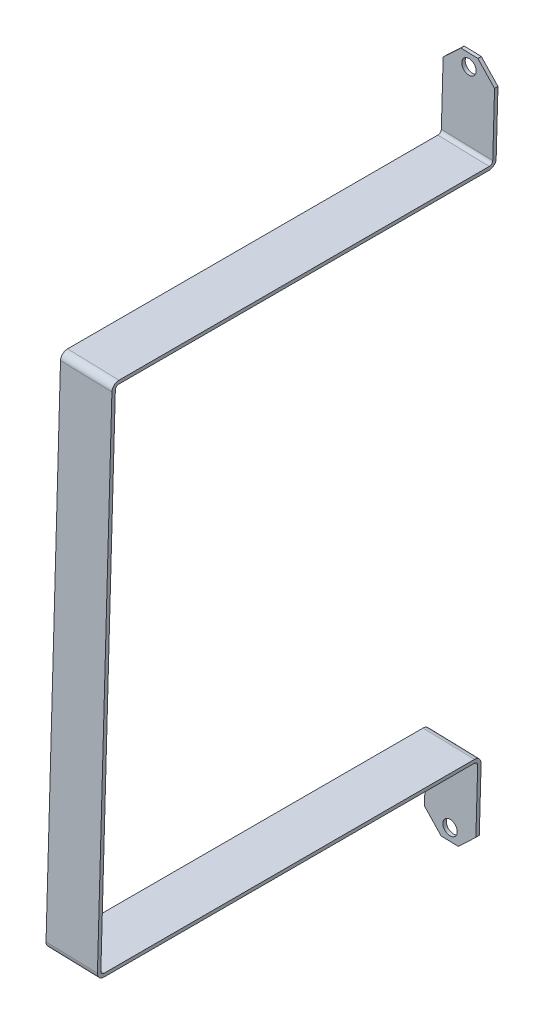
ISO-10303-21;
HEADER;
FILE_DESCRIPTION(('STEP AP214'),'2;1');
FILE_NAME('part.step','',(''),(''),'','','');
FILE_SCHEMA(('AUTOMOTIVE_DESIGN { 1 0 10303 214 1 1 1 1 }'));
ENDSEC;
DATA;
#1=APPLICATION_CONTEXT('core data for automotive mechanical design processes');
#2=APPLICATION_PROTOCOL_DEFINITION('international standard','automotive_design',2000,#1);
#3=PRODUCT_CONTEXT('',#1,'mechanical');
#4=PRODUCT('Part','Part','',(#3));
#5=PRODUCT_RELATED_PRODUCT_CATEGORY('part','',(#4));
#6=PRODUCT_DEFINITION_FORMATION('','',#4);
#7=PRODUCT_DEFINITION_CONTEXT('part definition',#1,'design');
#8=PRODUCT_DEFINITION('design','',#6,#7);
#9=PRODUCT_DEFINITION_SHAPE('','',#8);
#10=(LENGTH_UNIT() NAMED_UNIT(*) SI_UNIT(.MILLI.,.METRE.));
#11=(NAMED_UNIT(*) PLANE_ANGLE_UNIT() SI_UNIT($,.RADIAN.));
#12=(NAMED_UNIT(*) SI_UNIT($,.STERADIAN.) SOLID_ANGLE_UNIT());
#13=UNCERTAINTY_MEASURE_WITH_UNIT(LENGTH_MEASURE(1.E-05),#10,'distance_accuracy_value','');
#14=(GEOMETRIC_REPRESENTATION_CONTEXT(3) GLOBAL_UNCERTAINTY_ASSIGNED_CONTEXT((#13)) GLOBAL_UNIT_ASSIGNED_CONTEXT((#10,
#11,#12)) REPRESENTATION_CONTEXT('',''));
#15=CARTESIAN_POINT('',(0.,0.,0.));
#16=DIRECTION('',(0.,0.,1.));
#17=DIRECTION('',(1.,0.,0.));
#18=AXIS2_PLACEMENT_3D('',#15,#16,#17);
#19=CARTESIAN_POINT('',(-263.367826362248,108.51259003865,2.53567156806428E-13));
#20=DIRECTION('',(-0.0283593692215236,-0.999597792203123,0.));
#21=DIRECTION('',(0.999597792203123,-0.0283593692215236,0.));
#22=AXIS2_PLACEMENT_3D('',#19,#20,#21);
#23=PLANE('',#22);
#24=DIRECTION('',(-0.999597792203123,0.0283593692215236,0.));
#25=VECTOR('',#24,1.);
#26=CARTESIAN_POINT('',(-263.367826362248,108.51259003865,1.00000000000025));
#27=LINE('',#26,#25);
#28=CARTESIAN_POINT('',(-268.365815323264,108.654386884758,1.00000000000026));
#29=VERTEX_POINT('',#28);
#30=CARTESIAN_POINT('',(-273.363804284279,108.796183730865,1.00000000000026));
#31=VERTEX_POINT('',#30);
#32=EDGE_CURVE('E212',#29,#31,#27,.T.);
#33=ORIENTED_EDGE('',*,*,#32,.F.);
#34=DIRECTION('',(0.,0.,-1.));
#35=VECTOR('',#34,1.);
#36=CARTESIAN_POINT('',(-268.365815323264,108.654386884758,2.55926380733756E-13));
#37=LINE('',#36,#35);
#38=CARTESIAN_POINT('',(-268.365815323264,108.654386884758,2.55740360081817E-13));
#39=VERTEX_POINT('',#38);
#40=EDGE_CURVE('E354',#29,#39,#37,.T.);
#41=ORIENTED_EDGE('',*,*,#40,.T.);
#42=DIRECTION('',(-0.999597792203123,0.0283593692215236,0.));
#43=VECTOR('',#42,1.);
#44=CARTESIAN_POINT('',(-263.367826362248,108.51259003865,2.53567156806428E-13));
#45=LINE('',#44,#43);
#46=CARTESIAN_POINT('',(-273.363804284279,108.796183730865,2.58285604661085E-13));
#47=VERTEX_POINT('',#46);
#48=EDGE_CURVE('E254',#39,#47,#45,.T.);
#49=ORIENTED_EDGE('',*,*,#48,.T.);
#50=DIRECTION('',(0.,0.,1.));
#51=VECTOR('',#50,1.);
#52=CARTESIAN_POINT('',(-273.363804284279,108.796183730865,1.00000000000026));
#53=LINE('',#52,#51);
#54=EDGE_CURVE('E351',#47,#31,#53,.T.);
#55=ORIENTED_EDGE('',*,*,#54,.T.);
#56=EDGE_LOOP('',(#33,#41,#49,#55));
#57=FACE_BOUND('',#56,.T.);
#58=ADVANCED_FACE('F32',(#57),#23,.F.);
#59=CARTESIAN_POINT('',(-263.367826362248,108.51259003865,1.00000000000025));
#60=DIRECTION('',(0.,0.,-1.));
#61=DIRECTION('',(0.,1.,0.));
#62=AXIS2_PLACEMENT_3D('',#59,#60,#61);
#63=PLANE('',#62);
#64=CARTESIAN_POINT('',(-270.964067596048,105.2266930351,0.99999999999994));
#65=DIRECTION('',(0.,0.,1.));
#66=DIRECTION('',(1.,0.,0.));
#67=AXIS2_PLACEMENT_3D('',#64,#65,#66);
#68=CIRCLE('',#67,2.09999999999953);
#69=CARTESIAN_POINT('',(-268.864067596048,105.2266930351,0.99999999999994));
#70=VERTEX_POINT('',#69);
#71=EDGE_CURVE('E708',#70,#70,#68,.T.);
#72=ORIENTED_EDGE('',*,*,#71,.F.);
#73=EDGE_LOOP('',(#72));
#74=FACE_BOUND('',#73,.T.);
#75=DIRECTION('',(-0.0283593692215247,-0.999597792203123,0.));
#76=VECTOR('',#75,1.);
#77=CARTESIAN_POINT('',(-263.367826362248,108.51259003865,1.00000000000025));
#78=LINE('',#77,#76);
#79=CARTESIAN_POINT('',(-263.509623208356,103.514601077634,1.00000000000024));
#80=VERTEX_POINT('',#79);
#81=CARTESIAN_POINT('',(-264.034271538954,85.0220419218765,1.0000000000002));
#82=VERTEX_POINT('',#81);
#83=EDGE_CURVE('E193',#80,#82,#78,.T.);
#84=ORIENTED_EDGE('',*,*,#83,.F.);
#85=DIRECTION('',(0.686769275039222,-0.726875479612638,0.));
#86=VECTOR('',#85,1.);
#87=CARTESIAN_POINT('',(-263.509623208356,103.514601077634,1.00000000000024));
#88=LINE('',#87,#86);
#89=EDGE_CURVE('E349',#80,#29,#88,.F.);
#90=ORIENTED_EDGE('',*,*,#89,.T.);
#91=ORIENTED_EDGE('',*,*,#32,.T.);
#92=DIRECTION('',(-0.726875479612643,-0.686769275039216,0.));
#93=VECTOR('',#92,1.);
#94=CARTESIAN_POINT('',(-273.363804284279,108.796183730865,1.00000000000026));
#95=LINE('',#94,#93);
#96=CARTESIAN_POINT('',(-278.503590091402,103.939991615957,1.00000000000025));
#97=VERTEX_POINT('',#96);
#98=EDGE_CURVE('E347',#31,#97,#95,.T.);
#99=ORIENTED_EDGE('',*,*,#98,.T.);
#100=DIRECTION('',(-0.0283593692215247,-0.999597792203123,0.));
#101=VECTOR('',#100,1.);
#102=CARTESIAN_POINT('',(-278.361793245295,108.937980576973,1.00000000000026));
#103=LINE('',#102,#101);
#104=CARTESIAN_POINT('',(-279.028238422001,85.4474324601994,1.00000000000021));
#105=VERTEX_POINT('',#104);
#106=EDGE_CURVE('E209',#97,#105,#103,.T.);
#107=ORIENTED_EDGE('',*,*,#106,.T.);
#108=DIRECTION('',(-0.999597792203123,0.0283593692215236,0.));
#109=VECTOR('',#108,1.);
#110=CARTESIAN_POINT('',(-264.034271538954,85.0220419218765,1.0000000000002));
#111=LINE('',#110,#109);
#112=EDGE_CURVE('E206',#82,#105,#111,.T.);
#113=ORIENTED_EDGE('',*,*,#112,.F.);
#114=EDGE_LOOP('',(#84,#90,#91,#99,#107,#113));
#115=FACE_BOUND('',#114,.T.);
#116=ADVANCED_FACE('F207',(#74,#115),#63,.F.);
#117=CARTESIAN_POINT('',(-264.034271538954,85.0220419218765,2.0000000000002));
#118=DIRECTION('',(-0.999597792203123,0.0283593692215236,0.));
#119=DIRECTION('',(-0.0283593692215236,-0.999597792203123,0.));
#120=AXIS2_PLACEMENT_3D('',#117,#118,#119);
#121=CYLINDRICAL_SURFACE('',#120,1.);
#122=CARTESIAN_POINT('',(-279.028238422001,85.4474324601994,2.00000000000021));
#123=DIRECTION('',(-0.999597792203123,0.0283593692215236,0.));
#124=DIRECTION('',(-0.0283593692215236,-0.999597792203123,0.));
#125=AXIS2_PLACEMENT_3D('',#122,#123,#124);
#126=CIRCLE('',#125,1.);
#127=CARTESIAN_POINT('',(-279.056597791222,84.4478346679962,2.00000000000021));
#128=VERTEX_POINT('',#127);
#129=EDGE_CURVE('E256',#105,#128,#126,.T.);
#130=ORIENTED_EDGE('',*,*,#129,.T.);
#131=DIRECTION('',(-0.999597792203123,0.0283593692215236,0.));
#132=VECTOR('',#131,1.);
#133=CARTESIAN_POINT('',(-264.062630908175,84.0224441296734,2.0000000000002));
#134=LINE('',#133,#132);
#135=CARTESIAN_POINT('',(-264.062630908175,84.0224441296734,2.0000000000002));
#136=VERTEX_POINT('',#135);
#137=EDGE_CURVE('E213',#136,#128,#134,.T.);
#138=ORIENTED_EDGE('',*,*,#137,.F.);
#139=CARTESIAN_POINT('',(-264.034271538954,85.0220419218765,2.0000000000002));
#140=DIRECTION('',(-0.999597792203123,0.0283593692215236,0.));
#141=DIRECTION('',(-0.0283593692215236,-0.999597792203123,0.));
#142=AXIS2_PLACEMENT_3D('',#139,#140,#141);
#143=CIRCLE('',#142,1.);
#144=EDGE_CURVE('E198',#82,#136,#143,.T.);
#145=ORIENTED_EDGE('',*,*,#144,.F.);
#146=ORIENTED_EDGE('',*,*,#112,.T.);
#147=EDGE_LOOP('',(#130,#138,#145,#146));
#148=FACE_BOUND('',#147,.T.);
#149=ADVANCED_FACE('F215',(#148),#121,.F.);
#150=CARTESIAN_POINT('',(-264.062630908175,84.0224441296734,2.0000000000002));
#151=DIRECTION('',(-0.0283593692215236,-0.999597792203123,0.));
#152=DIRECTION('',(0.999597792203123,-0.0283593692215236,0.));
#153=AXIS2_PLACEMENT_3D('',#150,#151,#152);
#154=PLANE('',#153);
#155=DIRECTION('',(0.,0.,1.));
#156=VECTOR('',#155,1.);
#157=CARTESIAN_POINT('',(-279.056597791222,84.4478346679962,2.00000000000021));
#158=LINE('',#157,#156);
#159=CARTESIAN_POINT('',(-279.056597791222,84.447834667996,110.));
#160=VERTEX_POINT('',#159);
#161=EDGE_CURVE('E259',#128,#160,#158,.T.);
#162=ORIENTED_EDGE('',*,*,#161,.T.);
#163=DIRECTION('',(-0.999597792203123,0.0283593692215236,0.));
#164=VECTOR('',#163,1.);
#165=CARTESIAN_POINT('',(-264.062630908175,84.0224441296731,110.));
#166=LINE('',#165,#164);
#167=CARTESIAN_POINT('',(-264.062630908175,84.0224441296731,110.));
#168=VERTEX_POINT('',#167);
#169=EDGE_CURVE('E337',#168,#160,#166,.T.);
#170=ORIENTED_EDGE('',*,*,#169,.F.);
#171=DIRECTION('',(0.,0.,1.));
#172=VECTOR('',#171,1.);
#173=CARTESIAN_POINT('',(-264.062630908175,84.0224441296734,2.0000000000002));
#174=LINE('',#173,#172);
#175=EDGE_CURVE('E218',#136,#168,#174,.T.);
#176=ORIENTED_EDGE('',*,*,#175,.F.);
#177=ORIENTED_EDGE('',*,*,#137,.T.);
#178=EDGE_LOOP('',(#162,#170,#176,#177));
#179=FACE_BOUND('',#178,.T.);
#180=ADVANCED_FACE('F445',(#179),#154,.F.);
#181=CARTESIAN_POINT('',(-264.119349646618,82.0232485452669,110.));
#182=DIRECTION('',(-0.999597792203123,0.0283593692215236,0.));
#183=DIRECTION('',(-0.0283593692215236,-0.999597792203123,0.));
#184=AXIS2_PLACEMENT_3D('',#181,#182,#183);
#185=CYLINDRICAL_SURFACE('',#184,2.);
#186=CARTESIAN_POINT('',(-279.113316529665,82.4486390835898,110.));
#187=DIRECTION('',(0.999597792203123,-0.0283593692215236,0.));
#188=DIRECTION('',(0.0283593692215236,0.999597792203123,0.));
#189=AXIS2_PLACEMENT_3D('',#186,#187,#188);
#190=CIRCLE('',#189,2.);
#191=CARTESIAN_POINT('',(-279.113316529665,82.4486390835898,112.));
#192=VERTEX_POINT('',#191);
#193=EDGE_CURVE('E261',#160,#192,#190,.T.);
#194=ORIENTED_EDGE('',*,*,#193,.T.);
#195=DIRECTION('',(-0.999597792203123,0.0283593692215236,0.));
#196=VECTOR('',#195,1.);
#197=CARTESIAN_POINT('',(-264.119349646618,82.0232485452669,112.));
#198=LINE('',#197,#196);
#199=CARTESIAN_POINT('',(-264.119349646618,82.0232485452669,112.));
#200=VERTEX_POINT('',#199);
#201=EDGE_CURVE('E334',#200,#192,#198,.T.);
#202=ORIENTED_EDGE('',*,*,#201,.F.);
#203=CARTESIAN_POINT('',(-264.119349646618,82.0232485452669,110.));
#204=DIRECTION('',(0.999597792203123,-0.0283593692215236,0.));
#205=DIRECTION('',(0.0283593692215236,0.999597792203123,0.));
#206=AXIS2_PLACEMENT_3D('',#203,#204,#205);
#207=CIRCLE('',#206,2.);
#208=EDGE_CURVE('E220',#168,#200,#207,.T.);
#209=ORIENTED_EDGE('',*,*,#208,.F.);
#210=ORIENTED_EDGE('',*,*,#169,.T.);
#211=EDGE_LOOP('',(#194,#202,#209,#210));
#212=FACE_BOUND('',#211,.T.);
#213=ADVANCED_FACE('F452',(#212),#185,.T.);
#214=CARTESIAN_POINT('',(-268.344895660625,-66.9168224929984,112.));
#215=DIRECTION('',(0.,0.,-1.));
#216=DIRECTION('',(0.,1.,0.));
#217=AXIS2_PLACEMENT_3D('',#214,#215,#216);
#218=PLANE('',#217);
#219=DIRECTION('',(-0.0283593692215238,-0.999597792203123,0.));
#220=VECTOR('',#219,1.);
#221=CARTESIAN_POINT('',(-283.338862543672,-66.4914319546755,112.));
#222=LINE('',#221,#220);
#223=CARTESIAN_POINT('',(-283.338862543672,-66.4914319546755,112.));
#224=VERTEX_POINT('',#223);
#225=EDGE_CURVE('E263',#192,#224,#222,.T.);
#226=ORIENTED_EDGE('',*,*,#225,.T.);
#227=DIRECTION('',(-0.999597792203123,0.0283593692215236,0.));
#228=VECTOR('',#227,1.);
#229=CARTESIAN_POINT('',(-268.344895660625,-66.9168224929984,112.));
#230=LINE('',#229,#228);
#231=CARTESIAN_POINT('',(-268.344895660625,-66.9168224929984,112.));
#232=VERTEX_POINT('',#231);
#233=EDGE_CURVE('E331',#232,#224,#230,.T.);
#234=ORIENTED_EDGE('',*,*,#233,.F.);
#235=DIRECTION('',(-0.0283593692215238,-0.999597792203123,0.));
#236=VECTOR('',#235,1.);
#237=CARTESIAN_POINT('',(-268.344895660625,-66.9168224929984,112.));
#238=LINE('',#237,#236);
#239=EDGE_CURVE('E225',#200,#232,#238,.T.);
#240=ORIENTED_EDGE('',*,*,#239,.F.);
#241=ORIENTED_EDGE('',*,*,#201,.T.);
#242=EDGE_LOOP('',(#226,#234,#240,#241));
#243=FACE_BOUND('',#242,.T.);
#244=ADVANCED_FACE('F455',(#243),#218,.F.);
#245=CARTESIAN_POINT('',(-268.344895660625,-66.9168224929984,110.));
#246=DIRECTION('',(-0.999597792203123,0.0283593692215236,0.));
#247=DIRECTION('',(-0.0283593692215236,-0.999597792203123,0.));
#248=AXIS2_PLACEMENT_3D('',#245,#246,#247);
#249=CYLINDRICAL_SURFACE('',#248,2.00000000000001);
#250=CARTESIAN_POINT('',(-283.338862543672,-66.4914319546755,110.));
#251=DIRECTION('',(0.999597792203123,-0.0283593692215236,0.));
#252=DIRECTION('',(0.0283593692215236,0.999597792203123,0.));
#253=AXIS2_PLACEMENT_3D('',#250,#251,#252);
#254=CIRCLE('',#253,2.00000000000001);
#255=CARTESIAN_POINT('',(-283.395581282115,-68.4906275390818,110.));
#256=VERTEX_POINT('',#255);
#257=EDGE_CURVE('E265',#224,#256,#254,.T.);
#258=ORIENTED_EDGE('',*,*,#257,.T.);
#259=DIRECTION('',(-0.999597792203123,0.0283593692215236,0.));
#260=VECTOR('',#259,1.);
#261=CARTESIAN_POINT('',(-268.401614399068,-68.9160180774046,110.));
#262=LINE('',#261,#260);
#263=CARTESIAN_POINT('',(-268.401614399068,-68.9160180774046,110.));
#264=VERTEX_POINT('',#263);
#265=EDGE_CURVE('E328',#264,#256,#262,.T.);
#266=ORIENTED_EDGE('',*,*,#265,.F.);
#267=CARTESIAN_POINT('',(-268.344895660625,-66.9168224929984,110.));
#268=DIRECTION('',(0.999597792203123,-0.0283593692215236,0.));
#269=DIRECTION('',(0.0283593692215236,0.999597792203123,0.));
#270=AXIS2_PLACEMENT_3D('',#267,#268,#269);
#271=CIRCLE('',#270,2.00000000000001);
#272=EDGE_CURVE('E227',#232,#264,#271,.T.);
#273=ORIENTED_EDGE('',*,*,#272,.F.);
#274=ORIENTED_EDGE('',*,*,#233,.T.);
#275=EDGE_LOOP('',(#258,#266,#273,#274));
#276=FACE_BOUND('',#275,.T.);
#277=ADVANCED_FACE('F460',(#276),#249,.T.);
#278=CARTESIAN_POINT('',(-268.401614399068,-68.9160180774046,110.));
#279=DIRECTION('',(0.0283593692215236,0.999597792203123,0.));
#280=DIRECTION('',(-0.999597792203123,0.0283593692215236,0.));
#281=AXIS2_PLACEMENT_3D('',#278,#279,#280);
#282=PLANE('',#281);
#283=DIRECTION('',(0.,0.,-1.));
#284=VECTOR('',#283,1.);
#285=CARTESIAN_POINT('',(-283.395581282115,-68.4906275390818,110.));
#286=LINE('',#285,#284);
#287=CARTESIAN_POINT('',(-283.395581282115,-68.4906275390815,1.99999999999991));
#288=VERTEX_POINT('',#287);
#289=EDGE_CURVE('E267',#256,#288,#286,.T.);
#290=ORIENTED_EDGE('',*,*,#289,.T.);
#291=DIRECTION('',(-0.999597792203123,0.0283593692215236,0.));
#292=VECTOR('',#291,1.);
#293=CARTESIAN_POINT('',(-268.401614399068,-68.9160180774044,1.9999999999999));
#294=LINE('',#293,#292);
#295=CARTESIAN_POINT('',(-268.401614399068,-68.9160180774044,1.9999999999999));
#296=VERTEX_POINT('',#295);
#297=EDGE_CURVE('E325',#296,#288,#294,.T.);
#298=ORIENTED_EDGE('',*,*,#297,.F.);
#299=DIRECTION('',(0.,0.,-1.));
#300=VECTOR('',#299,1.);
#301=CARTESIAN_POINT('',(-268.401614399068,-68.9160180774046,110.));
#302=LINE('',#301,#300);
#303=EDGE_CURVE('E229',#264,#296,#302,.T.);
#304=ORIENTED_EDGE('',*,*,#303,.F.);
#305=ORIENTED_EDGE('',*,*,#265,.T.);
#306=EDGE_LOOP('',(#290,#298,#304,#305));
#307=FACE_BOUND('',#306,.T.);
#308=ADVANCED_FACE('F464',(#307),#282,.F.);
#309=CARTESIAN_POINT('',(-268.42997376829,-69.9156158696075,1.9999999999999));
#310=DIRECTION('',(-0.999597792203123,0.0283593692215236,0.));
#311=DIRECTION('',(-0.0283593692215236,-0.999597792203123,0.));
#312=AXIS2_PLACEMENT_3D('',#309,#310,#311);
#313=CYLINDRICAL_SURFACE('',#312,1.);
#314=CARTESIAN_POINT('',(-283.423940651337,-69.4902253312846,1.99999999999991));
#315=DIRECTION('',(-0.999597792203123,0.0283593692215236,0.));
#316=DIRECTION('',(-0.0283593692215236,-0.999597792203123,0.));
#317=AXIS2_PLACEMENT_3D('',#314,#315,#316);
#318=CIRCLE('',#317,1.);
#319=CARTESIAN_POINT('',(-283.423940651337,-69.4902253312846,0.99999999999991));
#320=VERTEX_POINT('',#319);
#321=EDGE_CURVE('E269',#288,#320,#318,.T.);
#322=ORIENTED_EDGE('',*,*,#321,.T.);
#323=DIRECTION('',(-0.999597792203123,0.0283593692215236,0.));
#324=VECTOR('',#323,1.);
#325=CARTESIAN_POINT('',(-268.42997376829,-69.9156158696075,0.999999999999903));
#326=LINE('',#325,#324);
#327=CARTESIAN_POINT('',(-268.42997376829,-69.9156158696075,0.999999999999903));
#328=VERTEX_POINT('',#327);
#329=EDGE_CURVE('E322',#328,#320,#326,.T.);
#330=ORIENTED_EDGE('',*,*,#329,.F.);
#331=CARTESIAN_POINT('',(-268.42997376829,-69.9156158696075,1.9999999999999));
#332=DIRECTION('',(-0.999597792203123,0.0283593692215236,0.));
#333=DIRECTION('',(-0.0283593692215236,-0.999597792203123,0.));
#334=AXIS2_PLACEMENT_3D('',#331,#332,#333);
#335=CIRCLE('',#334,1.);
#336=EDGE_CURVE('E231',#296,#328,#335,.T.);
#337=ORIENTED_EDGE('',*,*,#336,.F.);
#338=ORIENTED_EDGE('',*,*,#297,.T.);
#339=EDGE_LOOP('',(#322,#330,#337,#338));
#340=FACE_BOUND('',#339,.T.);
#341=ADVANCED_FACE('F468',(#340),#313,.F.);
#342=CARTESIAN_POINT('',(-268.42997376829,-69.9156158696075,0.999999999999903));
#343=DIRECTION('',(0.,0.,-1.));
#344=DIRECTION('',(0.,1.,0.));
#345=AXIS2_PLACEMENT_3D('',#342,#343,#344);
#346=PLANE('',#345);
#347=CARTESIAN_POINT('',(-276.494144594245,-89.6948764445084,0.99999999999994));
#348=DIRECTION('',(0.,0.,1.));
#349=DIRECTION('',(1.,0.,0.));
#350=AXIS2_PLACEMENT_3D('',#347,#348,#349);
#351=CIRCLE('',#350,2.10000000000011);
#352=CARTESIAN_POINT('',(-274.394144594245,-89.6948764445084,0.99999999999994));
#353=VERTEX_POINT('',#352);
#354=EDGE_CURVE('E704',#353,#353,#351,.T.);
#355=ORIENTED_EDGE('',*,*,#354,.F.);
#356=EDGE_LOOP('',(#355));
#357=FACE_BOUND('',#356,.T.);
#358=DIRECTION('',(-0.0283593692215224,-0.999597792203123,0.));
#359=VECTOR('',#358,1.);
#360=CARTESIAN_POINT('',(-283.423940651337,-69.4902253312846,0.99999999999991));
#361=LINE('',#360,#359);
#362=CARTESIAN_POINT('',(-283.948588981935,-87.9827844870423,0.999999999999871));
#363=VERTEX_POINT('',#362);
#364=EDGE_CURVE('E271',#320,#363,#361,.T.);
#365=ORIENTED_EDGE('',*,*,#364,.T.);
#366=DIRECTION('',(0.686769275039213,-0.726875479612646,0.));
#367=VECTOR('',#366,1.);
#368=CARTESIAN_POINT('',(-279.092396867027,-93.1225702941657,0.999999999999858));
#369=LINE('',#368,#367);
#370=CARTESIAN_POINT('',(-279.092396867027,-93.1225702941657,0.999999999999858));
#371=VERTEX_POINT('',#370);
#372=EDGE_CURVE('E11',#363,#371,#369,.T.);
#373=ORIENTED_EDGE('',*,*,#372,.T.);
#374=DIRECTION('',(-0.999597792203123,0.0283593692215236,0.));
#375=VECTOR('',#374,1.);
#376=CARTESIAN_POINT('',(-269.096418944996,-93.4061639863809,0.999999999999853));
#377=LINE('',#376,#375);
#378=CARTESIAN_POINT('',(-274.094407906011,-93.2643671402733,0.999999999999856));
#379=VERTEX_POINT('',#378);
#380=EDGE_CURVE('E320',#379,#371,#377,.T.);
#381=ORIENTED_EDGE('',*,*,#380,.F.);
#382=DIRECTION('',(-0.726875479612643,-0.686769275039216,0.));
#383=VECTOR('',#382,1.);
#384=CARTESIAN_POINT('',(-268.954622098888,-88.4081750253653,0.999999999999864));
#385=LINE('',#384,#383);
#386=CARTESIAN_POINT('',(-268.954622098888,-88.4081750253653,0.999999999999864));
#387=VERTEX_POINT('',#386);
#388=EDGE_CURVE('E40',#379,#387,#385,.F.);
#389=ORIENTED_EDGE('',*,*,#388,.T.);
#390=DIRECTION('',(-0.0283593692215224,-0.999597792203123,0.));
#391=VECTOR('',#390,1.);
#392=CARTESIAN_POINT('',(-268.42997376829,-69.9156158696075,0.999999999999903));
#393=LINE('',#392,#391);
#394=EDGE_CURVE('E233',#328,#387,#393,.T.);
#395=ORIENTED_EDGE('',*,*,#394,.F.);
#396=ORIENTED_EDGE('',*,*,#329,.T.);
#397=EDGE_LOOP('',(#365,#373,#381,#389,#395,#396));
#398=FACE_BOUND('',#397,.T.);
#399=ADVANCED_FACE('F373',(#357,#398),#346,.F.);
#400=CARTESIAN_POINT('',(-269.096418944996,-93.4061639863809,0.999999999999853));
#401=DIRECTION('',(0.0283593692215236,0.999597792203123,0.));
#402=DIRECTION('',(-0.999597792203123,0.0283593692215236,0.));
#403=AXIS2_PLACEMENT_3D('',#400,#401,#402);
#404=PLANE('',#403);
#405=ORIENTED_EDGE('',*,*,#380,.T.);
#406=DIRECTION('',(0.,0.,-1.));
#407=VECTOR('',#406,1.);
#408=CARTESIAN_POINT('',(-279.092396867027,-93.1225702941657,-1.41680374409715E-13));
#409=LINE('',#408,#407);
#410=CARTESIAN_POINT('',(-279.092396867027,-93.1225702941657,-1.41638589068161E-13));
#411=VERTEX_POINT('',#410);
#412=EDGE_CURVE('E365',#371,#411,#409,.T.);
#413=ORIENTED_EDGE('',*,*,#412,.T.);
#414=DIRECTION('',(-0.999597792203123,0.0283593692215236,0.));
#415=VECTOR('',#414,1.);
#416=CARTESIAN_POINT('',(-269.096418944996,-93.4061639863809,-1.46398822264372E-13));
#417=LINE('',#416,#415);
#418=CARTESIAN_POINT('',(-274.094407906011,-93.2643671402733,-1.44039598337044E-13));
#419=VERTEX_POINT('',#418);
#420=EDGE_CURVE('E317',#419,#411,#417,.T.);
#421=ORIENTED_EDGE('',*,*,#420,.F.);
#422=DIRECTION('',(0.,0.,1.));
#423=VECTOR('',#422,1.);
#424=CARTESIAN_POINT('',(-274.094407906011,-93.2643671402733,0.999999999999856));
#425=LINE('',#424,#423);
#426=EDGE_CURVE('E52',#419,#379,#425,.T.);
#427=ORIENTED_EDGE('',*,*,#426,.T.);
#428=EDGE_LOOP('',(#405,#413,#421,#427));
#429=FACE_BOUND('',#428,.T.);
#430=ADVANCED_FACE('F382',(#429),#404,.F.);
#431=CARTESIAN_POINT('',(-269.096418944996,-93.4061639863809,-1.46398822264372E-13));
#432=DIRECTION('',(0.,0.,1.));
#433=DIRECTION('',(0.,-1.,0.));
#434=AXIS2_PLACEMENT_3D('',#431,#432,#433);
#435=PLANE('',#434);
#436=CARTESIAN_POINT('',(-276.494144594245,-89.6948764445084,-1.46367293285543E-13));
#437=DIRECTION('',(0.,0.,1.));
#438=DIRECTION('',(1.,0.,0.));
#439=AXIS2_PLACEMENT_3D('',#436,#437,#438);
#440=CIRCLE('',#439,2.10000000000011);
#441=CARTESIAN_POINT('',(-274.394144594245,-89.6948764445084,-1.46367293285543E-13));
#442=VERTEX_POINT('',#441);
#443=EDGE_CURVE('E257',#442,#442,#440,.T.);
#444=ORIENTED_EDGE('',*,*,#443,.T.);
#445=EDGE_LOOP('',(#444));
#446=FACE_BOUND('',#445,.T.);
#447=ORIENTED_EDGE('',*,*,#420,.T.);
#448=DIRECTION('',(-0.686769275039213,0.726875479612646,0.));
#449=VECTOR('',#448,1.);
#450=CARTESIAN_POINT('',(-279.092396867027,-93.1225702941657,-1.41596803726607E-13));
#451=LINE('',#450,#449);
#452=CARTESIAN_POINT('',(-283.948588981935,-87.9827844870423,-1.29421002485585E-13));
#453=VERTEX_POINT('',#452);
#454=EDGE_CURVE('E370',#411,#453,#451,.T.);
#455=ORIENTED_EDGE('',*,*,#454,.T.);
#456=DIRECTION('',(0.0283593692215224,0.999597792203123,0.));
#457=VECTOR('',#456,1.);
#458=CARTESIAN_POINT('',(-284.090385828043,-92.980773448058,-1.39321150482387E-13));
#459=LINE('',#458,#457);
#460=CARTESIAN_POINT('',(-283.423940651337,-69.4902253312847,0.));
#461=VERTEX_POINT('',#460);
#462=EDGE_CURVE('E273',#453,#461,#459,.T.);
#463=ORIENTED_EDGE('',*,*,#462,.T.);
#464=DIRECTION('',(-0.999597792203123,0.0283593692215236,0.));
#465=VECTOR('',#464,1.);
#466=CARTESIAN_POINT('',(-268.42997376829,-69.9156158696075,-1.04152797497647E-13));
#467=LINE('',#466,#465);
#468=CARTESIAN_POINT('',(-268.42997376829,-69.9156158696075,-1.04152797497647E-13));
#469=VERTEX_POINT('',#468);
#470=EDGE_CURVE('E314',#469,#461,#467,.T.);
#471=ORIENTED_EDGE('',*,*,#470,.F.);
#472=DIRECTION('',(0.0283593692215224,0.999597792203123,0.));
#473=VECTOR('',#472,1.);
#474=CARTESIAN_POINT('',(-269.096418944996,-93.4061639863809,-1.46398822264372E-13));
#475=LINE('',#474,#473);
#476=CARTESIAN_POINT('',(-268.954622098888,-88.4081750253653,-1.36554074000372E-13));
#477=VERTEX_POINT('',#476);
#478=EDGE_CURVE('E236',#477,#469,#475,.T.);
#479=ORIENTED_EDGE('',*,*,#478,.F.);
#480=DIRECTION('',(0.726875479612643,0.686769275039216,0.));
#481=VECTOR('',#480,1.);
#482=CARTESIAN_POINT('',(-268.954622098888,-88.4081750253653,-1.36609473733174E-13));
#483=LINE('',#482,#481);
#484=EDGE_CURVE('E368',#477,#419,#483,.F.);
#485=ORIENTED_EDGE('',*,*,#484,.T.);
#486=EDGE_LOOP('',(#447,#455,#463,#471,#479,#485));
#487=FACE_BOUND('',#486,.T.);
#488=ADVANCED_FACE('F380',(#446,#487),#435,.F.);
#489=CARTESIAN_POINT('',(-268.42997376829,-69.9156158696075,1.9999999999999));
#490=DIRECTION('',(-0.999597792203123,0.0283593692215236,0.));
#491=DIRECTION('',(-0.0283593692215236,-0.999597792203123,0.));
#492=AXIS2_PLACEMENT_3D('',#489,#490,#491);
#493=CYLINDRICAL_SURFACE('',#492,2.);
#494=CARTESIAN_POINT('',(-283.423940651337,-69.4902253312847,1.99999999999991));
#495=DIRECTION('',(0.999597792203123,-0.0283593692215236,0.));
#496=DIRECTION('',(0.0283593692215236,0.999597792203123,0.));
#497=AXIS2_PLACEMENT_3D('',#494,#495,#496);
#498=CIRCLE('',#497,2.);
#499=CARTESIAN_POINT('',(-283.367221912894,-67.4910297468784,1.99999999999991));
#500=VERTEX_POINT('',#499);
#501=EDGE_CURVE('E275',#461,#500,#498,.T.);
#502=ORIENTED_EDGE('',*,*,#501,.T.);
#503=DIRECTION('',(-0.999597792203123,0.0283593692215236,0.));
#504=VECTOR('',#503,1.);
#505=CARTESIAN_POINT('',(-268.373255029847,-67.9164202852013,1.9999999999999));
#506=LINE('',#505,#504);
#507=CARTESIAN_POINT('',(-268.373255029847,-67.9164202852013,1.9999999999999));
#508=VERTEX_POINT('',#507);
#509=EDGE_CURVE('E311',#508,#500,#506,.T.);
#510=ORIENTED_EDGE('',*,*,#509,.F.);
#511=CARTESIAN_POINT('',(-268.42997376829,-69.9156158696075,1.9999999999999));
#512=DIRECTION('',(0.999597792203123,-0.0283593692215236,0.));
#513=DIRECTION('',(0.0283593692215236,0.999597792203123,0.));
#514=AXIS2_PLACEMENT_3D('',#511,#512,#513);
#515=CIRCLE('',#514,2.);
#516=EDGE_CURVE('E238',#469,#508,#515,.T.);
#517=ORIENTED_EDGE('',*,*,#516,.F.);
#518=ORIENTED_EDGE('',*,*,#470,.T.);
#519=EDGE_LOOP('',(#502,#510,#517,#518));
#520=FACE_BOUND('',#519,.T.);
#521=ADVANCED_FACE('F396',(#520),#493,.T.);
#522=CARTESIAN_POINT('',(-268.373255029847,-67.9164202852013,1.9999999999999));
#523=DIRECTION('',(-0.0283593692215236,-0.999597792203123,0.));
#524=DIRECTION('',(0.999597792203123,-0.0283593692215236,0.));
#525=AXIS2_PLACEMENT_3D('',#522,#523,#524);
#526=PLANE('',#525);
#527=DIRECTION('',(0.,0.,1.));
#528=VECTOR('',#527,1.);
#529=CARTESIAN_POINT('',(-283.367221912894,-67.4910297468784,1.99999999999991));
#530=LINE('',#529,#528);
#531=CARTESIAN_POINT('',(-283.367221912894,-67.4910297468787,110.));
#532=VERTEX_POINT('',#531);
#533=EDGE_CURVE('E277',#500,#532,#530,.T.);
#534=ORIENTED_EDGE('',*,*,#533,.T.);
#535=DIRECTION('',(-0.999597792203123,0.0283593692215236,0.));
#536=VECTOR('',#535,1.);
#537=CARTESIAN_POINT('',(-268.373255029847,-67.9164202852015,110.));
#538=LINE('',#537,#536);
#539=CARTESIAN_POINT('',(-268.373255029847,-67.9164202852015,110.));
#540=VERTEX_POINT('',#539);
#541=EDGE_CURVE('E308',#540,#532,#538,.T.);
#542=ORIENTED_EDGE('',*,*,#541,.F.);
#543=DIRECTION('',(0.,0.,1.));
#544=VECTOR('',#543,1.);
#545=CARTESIAN_POINT('',(-268.373255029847,-67.9164202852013,1.9999999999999));
#546=LINE('',#545,#544);
#547=EDGE_CURVE('E240',#508,#540,#546,.T.);
#548=ORIENTED_EDGE('',*,*,#547,.F.);
#549=ORIENTED_EDGE('',*,*,#509,.T.);
#550=EDGE_LOOP('',(#534,#542,#548,#549));
#551=FACE_BOUND('',#550,.T.);
#552=ADVANCED_FACE('F400',(#551),#526,.F.);
#553=CARTESIAN_POINT('',(-268.344895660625,-66.9168224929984,110.));
#554=DIRECTION('',(-0.999597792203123,0.0283593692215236,0.));
#555=DIRECTION('',(-0.0283593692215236,-0.999597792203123,0.));
#556=AXIS2_PLACEMENT_3D('',#553,#554,#555);
#557=CYLINDRICAL_SURFACE('',#556,1.);
#558=CARTESIAN_POINT('',(-283.338862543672,-66.4914319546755,110.));
#559=DIRECTION('',(-0.999597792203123,0.0283593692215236,0.));
#560=DIRECTION('',(-0.0283593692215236,-0.999597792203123,0.));
#561=AXIS2_PLACEMENT_3D('',#558,#559,#560);
#562=CIRCLE('',#561,1.);
#563=CARTESIAN_POINT('',(-283.338862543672,-66.4914319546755,111.));
#564=VERTEX_POINT('',#563);
#565=EDGE_CURVE('E279',#532,#564,#562,.T.);
#566=ORIENTED_EDGE('',*,*,#565,.T.);
#567=DIRECTION('',(-0.999597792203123,0.0283593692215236,0.));
#568=VECTOR('',#567,1.);
#569=CARTESIAN_POINT('',(-268.344895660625,-66.9168224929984,111.));
#570=LINE('',#569,#568);
#571=CARTESIAN_POINT('',(-268.344895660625,-66.9168224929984,111.));
#572=VERTEX_POINT('',#571);
#573=EDGE_CURVE('E305',#572,#564,#570,.T.);
#574=ORIENTED_EDGE('',*,*,#573,.F.);
#575=CARTESIAN_POINT('',(-268.344895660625,-66.9168224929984,110.));
#576=DIRECTION('',(-0.999597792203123,0.0283593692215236,0.));
#577=DIRECTION('',(-0.0283593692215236,-0.999597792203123,0.));
#578=AXIS2_PLACEMENT_3D('',#575,#576,#577);
#579=CIRCLE('',#578,1.);
#580=EDGE_CURVE('E242',#540,#572,#579,.T.);
#581=ORIENTED_EDGE('',*,*,#580,.F.);
#582=ORIENTED_EDGE('',*,*,#541,.T.);
#583=EDGE_LOOP('',(#566,#574,#581,#582));
#584=FACE_BOUND('',#583,.T.);
#585=ADVANCED_FACE('F407',(#584),#557,.F.);
#586=CARTESIAN_POINT('',(-268.344895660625,-66.9168224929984,111.));
#587=DIRECTION('',(0.,0.,1.));
#588=DIRECTION('',(0.,-1.,0.));
#589=AXIS2_PLACEMENT_3D('',#586,#587,#588);
#590=PLANE('',#589);
#591=DIRECTION('',(0.0283593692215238,0.999597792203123,0.));
#592=VECTOR('',#591,1.);
#593=CARTESIAN_POINT('',(-283.338862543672,-66.4914319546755,111.));
#594=LINE('',#593,#592);
#595=CARTESIAN_POINT('',(-279.113316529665,82.4486390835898,111.));
#596=VERTEX_POINT('',#595);
#597=EDGE_CURVE('E281',#564,#596,#594,.T.);
#598=ORIENTED_EDGE('',*,*,#597,.T.);
#599=DIRECTION('',(-0.999597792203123,0.0283593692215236,0.));
#600=VECTOR('',#599,1.);
#601=CARTESIAN_POINT('',(-264.119349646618,82.0232485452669,111.));
#602=LINE('',#601,#600);
#603=CARTESIAN_POINT('',(-264.119349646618,82.0232485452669,111.));
#604=VERTEX_POINT('',#603);
#605=EDGE_CURVE('E302',#604,#596,#602,.T.);
#606=ORIENTED_EDGE('',*,*,#605,.F.);
#607=DIRECTION('',(0.0283593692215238,0.999597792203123,0.));
#608=VECTOR('',#607,1.);
#609=CARTESIAN_POINT('',(-268.344895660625,-66.9168224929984,111.));
#610=LINE('',#609,#608);
#611=EDGE_CURVE('E244',#572,#604,#610,.T.);
#612=ORIENTED_EDGE('',*,*,#611,.F.);
#613=ORIENTED_EDGE('',*,*,#573,.T.);
#614=EDGE_LOOP('',(#598,#606,#612,#613));
#615=FACE_BOUND('',#614,.T.);
#616=ADVANCED_FACE('F410',(#615),#590,.F.);
#617=CARTESIAN_POINT('',(-264.119349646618,82.0232485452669,110.));
#618=DIRECTION('',(-0.999597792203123,0.0283593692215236,0.));
#619=DIRECTION('',(-0.0283593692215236,-0.999597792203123,0.));
#620=AXIS2_PLACEMENT_3D('',#617,#618,#619);
#621=CYLINDRICAL_SURFACE('',#620,0.999999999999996);
#622=CARTESIAN_POINT('',(-279.113316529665,82.4486390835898,110.));
#623=DIRECTION('',(-0.999597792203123,0.0283593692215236,0.));
#624=DIRECTION('',(0.0283593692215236,0.999597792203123,0.));
#625=AXIS2_PLACEMENT_3D('',#622,#623,#624);
#626=CIRCLE('',#625,0.999999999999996);
#627=CARTESIAN_POINT('',(-279.084957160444,83.4482368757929,110.));
#628=VERTEX_POINT('',#627);
#629=EDGE_CURVE('E283',#596,#628,#626,.T.);
#630=ORIENTED_EDGE('',*,*,#629,.T.);
#631=DIRECTION('',(-0.999597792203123,0.0283593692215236,0.));
#632=VECTOR('',#631,1.);
#633=CARTESIAN_POINT('',(-264.090990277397,83.02284633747,110.));
#634=LINE('',#633,#632);
#635=CARTESIAN_POINT('',(-264.090990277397,83.02284633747,110.));
#636=VERTEX_POINT('',#635);
#637=EDGE_CURVE('E299',#636,#628,#634,.T.);
#638=ORIENTED_EDGE('',*,*,#637,.F.);
#639=CARTESIAN_POINT('',(-264.119349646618,82.0232485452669,110.));
#640=DIRECTION('',(-0.999597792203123,0.0283593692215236,0.));
#641=DIRECTION('',(0.0283593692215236,0.999597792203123,0.));
#642=AXIS2_PLACEMENT_3D('',#639,#640,#641);
#643=CIRCLE('',#642,0.999999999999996);
#644=EDGE_CURVE('E246',#604,#636,#643,.T.);
#645=ORIENTED_EDGE('',*,*,#644,.F.);
#646=ORIENTED_EDGE('',*,*,#605,.T.);
#647=EDGE_LOOP('',(#630,#638,#645,#646));
#648=FACE_BOUND('',#647,.T.);
#649=ADVANCED_FACE('F415',(#648),#621,.F.);
#650=CARTESIAN_POINT('',(-264.090990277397,83.0228463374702,2.0000000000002));
#651=DIRECTION('',(0.0283593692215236,0.999597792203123,0.));
#652=DIRECTION('',(-0.999597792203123,0.0283593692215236,0.));
#653=AXIS2_PLACEMENT_3D('',#650,#651,#652);
#654=PLANE('',#653);
#655=DIRECTION('',(0.,0.,-1.));
#656=VECTOR('',#655,1.);
#657=CARTESIAN_POINT('',(-279.084957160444,83.4482368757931,2.00000000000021));
#658=LINE('',#657,#656);
#659=CARTESIAN_POINT('',(-279.084957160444,83.4482368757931,2.00000000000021));
#660=VERTEX_POINT('',#659);
#661=EDGE_CURVE('E285',#628,#660,#658,.T.);
#662=ORIENTED_EDGE('',*,*,#661,.T.);
#663=DIRECTION('',(-0.999597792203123,0.0283593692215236,0.));
#664=VECTOR('',#663,1.);
#665=CARTESIAN_POINT('',(-264.090990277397,83.0228463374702,2.0000000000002));
#666=LINE('',#665,#664);
#667=CARTESIAN_POINT('',(-264.090990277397,83.0228463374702,2.0000000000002));
#668=VERTEX_POINT('',#667);
#669=EDGE_CURVE('E296',#668,#660,#666,.T.);
#670=ORIENTED_EDGE('',*,*,#669,.F.);
#671=DIRECTION('',(0.,0.,-1.));
#672=VECTOR('',#671,1.);
#673=CARTESIAN_POINT('',(-264.090990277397,83.0228463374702,2.0000000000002));
#674=LINE('',#673,#672);
#675=EDGE_CURVE('E248',#636,#668,#674,.T.);
#676=ORIENTED_EDGE('',*,*,#675,.F.);
#677=ORIENTED_EDGE('',*,*,#637,.T.);
#678=EDGE_LOOP('',(#662,#670,#676,#677));
#679=FACE_BOUND('',#678,.T.);
#680=ADVANCED_FACE('F421',(#679),#654,.F.);
#681=CARTESIAN_POINT('',(-264.034271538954,85.0220419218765,2.00000000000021));
#682=DIRECTION('',(-0.999597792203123,0.0283593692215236,0.));
#683=DIRECTION('',(-0.0283593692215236,-0.999597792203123,0.));
#684=AXIS2_PLACEMENT_3D('',#681,#682,#683);
#685=CYLINDRICAL_SURFACE('',#684,2.);
#686=CARTESIAN_POINT('',(-279.028238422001,85.4474324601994,2.00000000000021));
#687=DIRECTION('',(0.999597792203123,-0.0283593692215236,0.));
#688=DIRECTION('',(-0.0283593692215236,-0.999597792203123,0.));
#689=AXIS2_PLACEMENT_3D('',#686,#687,#688);
#690=CIRCLE('',#689,2.);
#691=CARTESIAN_POINT('',(-279.028238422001,85.4474324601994,2.14114133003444E-13));
#692=VERTEX_POINT('',#691);
#693=EDGE_CURVE('E287',#660,#692,#690,.T.);
#694=ORIENTED_EDGE('',*,*,#693,.T.);
#695=DIRECTION('',(-0.999597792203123,0.0283593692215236,0.));
#696=VECTOR('',#695,1.);
#697=CARTESIAN_POINT('',(-264.034271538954,85.0220419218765,2.07036461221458E-13));
#698=LINE('',#697,#696);
#699=CARTESIAN_POINT('',(-264.034271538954,85.0220419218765,2.07036461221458E-13));
#700=VERTEX_POINT('',#699);
#701=EDGE_CURVE('E293',#700,#692,#698,.T.);
#702=ORIENTED_EDGE('',*,*,#701,.F.);
#703=CARTESIAN_POINT('',(-264.034271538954,85.0220419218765,2.00000000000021));
#704=DIRECTION('',(0.999597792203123,-0.0283593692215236,0.));
#705=DIRECTION('',(-0.0283593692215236,-0.999597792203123,0.));
#706=AXIS2_PLACEMENT_3D('',#703,#704,#705);
#707=CIRCLE('',#706,2.);
#708=EDGE_CURVE('E250',#668,#700,#707,.T.);
#709=ORIENTED_EDGE('',*,*,#708,.F.);
#710=ORIENTED_EDGE('',*,*,#669,.T.);
#711=EDGE_LOOP('',(#694,#702,#709,#710));
#712=FACE_BOUND('',#711,.T.);
#713=ADVANCED_FACE('F425',(#712),#685,.T.);
#714=CARTESIAN_POINT('',(-264.034271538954,85.0220419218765,2.07036461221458E-13));
#715=DIRECTION('',(0.,0.,1.));
#716=DIRECTION('',(0.,-1.,0.));
#717=AXIS2_PLACEMENT_3D('',#714,#715,#716);
#718=PLANE('',#717);
#719=CARTESIAN_POINT('',(-270.964067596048,105.2266930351,-1.46367293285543E-13));
#720=DIRECTION('',(0.,0.,1.));
#721=DIRECTION('',(1.,0.,0.));
#722=AXIS2_PLACEMENT_3D('',#719,#720,#721);
#723=CIRCLE('',#722,2.09999999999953);
#724=CARTESIAN_POINT('',(-268.864067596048,105.2266930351,-1.46367293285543E-13));
#725=VERTEX_POINT('',#724);
#726=EDGE_CURVE('E705',#725,#725,#723,.T.);
#727=ORIENTED_EDGE('',*,*,#726,.T.);
#728=EDGE_LOOP('',(#727));
#729=FACE_BOUND('',#728,.T.);
#730=ORIENTED_EDGE('',*,*,#48,.F.);
#731=DIRECTION('',(-0.686769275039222,0.726875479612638,0.));
#732=VECTOR('',#731,1.);
#733=CARTESIAN_POINT('',(-263.509623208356,103.514601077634,2.43294967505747E-13));
#734=LINE('',#733,#732);
#735=CARTESIAN_POINT('',(-263.509623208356,103.514601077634,2.43480988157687E-13));
#736=VERTEX_POINT('',#735);
#737=EDGE_CURVE('E358',#39,#736,#734,.F.);
#738=ORIENTED_EDGE('',*,*,#737,.T.);
#739=DIRECTION('',(0.0283593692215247,0.999597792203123,0.));
#740=VECTOR('',#739,1.);
#741=CARTESIAN_POINT('',(-264.034271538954,85.0220419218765,2.07036461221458E-13));
#742=LINE('',#741,#740);
#743=EDGE_CURVE('E252',#700,#736,#742,.T.);
#744=ORIENTED_EDGE('',*,*,#743,.F.);
#745=ORIENTED_EDGE('',*,*,#701,.T.);
#746=DIRECTION('',(0.0283593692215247,0.999597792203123,0.));
#747=VECTOR('',#746,1.);
#748=CARTESIAN_POINT('',(-279.028238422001,85.4474324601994,2.14114133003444E-13));
#749=LINE('',#748,#747);
#750=CARTESIAN_POINT('',(-278.503590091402,103.939991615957,2.50744680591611E-13));
#751=VERTEX_POINT('',#750);
#752=EDGE_CURVE('E203',#692,#751,#749,.T.);
#753=ORIENTED_EDGE('',*,*,#752,.T.);
#754=DIRECTION('',(0.726875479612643,0.686769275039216,0.));
#755=VECTOR('',#754,1.);
#756=CARTESIAN_POINT('',(-273.363804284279,108.796183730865,2.58285604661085E-13));
#757=LINE('',#756,#755);
#758=EDGE_CURVE('E356',#751,#47,#757,.T.);
#759=ORIENTED_EDGE('',*,*,#758,.T.);
#760=EDGE_LOOP('',(#730,#738,#744,#745,#753,#759));
#761=FACE_BOUND('',#760,.T.);
#762=ADVANCED_FACE('F430',(#729,#761),#718,.F.);
#763=CARTESIAN_POINT('',(-264.034271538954,85.0220419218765,2.0000000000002));
#764=DIRECTION('',(-0.999597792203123,0.0283593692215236,0.));
#765=DIRECTION('',(-0.0283593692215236,-0.999597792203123,0.));
#766=AXIS2_PLACEMENT_3D('',#763,#764,#765);
#767=PLANE('',#766);
#768=ORIENTED_EDGE('',*,*,#743,.T.);
#769=DIRECTION('',(0.,0.,1.));
#770=VECTOR('',#769,1.);
#771=CARTESIAN_POINT('',(-263.509623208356,103.514601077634,1.99999999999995));
#772=LINE('',#771,#770);
#773=EDGE_CURVE('E201',#736,#80,#772,.T.);
#774=ORIENTED_EDGE('',*,*,#773,.T.);
#775=ORIENTED_EDGE('',*,*,#83,.T.);
#776=ORIENTED_EDGE('',*,*,#144,.T.);
#777=ORIENTED_EDGE('',*,*,#175,.T.);
#778=ORIENTED_EDGE('',*,*,#208,.T.);
#779=ORIENTED_EDGE('',*,*,#239,.T.);
#780=ORIENTED_EDGE('',*,*,#272,.T.);
#781=ORIENTED_EDGE('',*,*,#303,.T.);
#782=ORIENTED_EDGE('',*,*,#336,.T.);
#783=ORIENTED_EDGE('',*,*,#394,.T.);
#784=DIRECTION('',(0.,0.,-1.));
#785=VECTOR('',#784,1.);
#786=CARTESIAN_POINT('',(-268.954622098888,-88.4081750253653,1.9999999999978));
#787=LINE('',#786,#785);
#788=EDGE_CURVE('E343',#387,#477,#787,.T.);
#789=ORIENTED_EDGE('',*,*,#788,.T.);
#790=ORIENTED_EDGE('',*,*,#478,.T.);
#791=ORIENTED_EDGE('',*,*,#516,.T.);
#792=ORIENTED_EDGE('',*,*,#547,.T.);
#793=ORIENTED_EDGE('',*,*,#580,.T.);
#794=ORIENTED_EDGE('',*,*,#611,.T.);
#795=ORIENTED_EDGE('',*,*,#644,.T.);
#796=ORIENTED_EDGE('',*,*,#675,.T.);
#797=ORIENTED_EDGE('',*,*,#708,.T.);
#798=EDGE_LOOP('',(#768,#774,#775,#776,#777,#778,#779,#780,#781,#782,#783,#789,#790,#791,#792,
#793,#794,#795,#796,#797));
#799=FACE_BOUND('',#798,.T.);
#800=ADVANCED_FACE('F196',(#799),#767,.F.);
#801=CARTESIAN_POINT('',(-279.028238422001,85.4474324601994,2.00000000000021));
#802=DIRECTION('',(-0.999597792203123,0.0283593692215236,0.));
#803=DIRECTION('',(-0.0283593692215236,-0.999597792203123,0.));
#804=AXIS2_PLACEMENT_3D('',#801,#802,#803);
#805=PLANE('',#804);
#806=ORIENTED_EDGE('',*,*,#106,.F.);
#807=DIRECTION('',(0.,0.,-1.));
#808=VECTOR('',#807,1.);
#809=CARTESIAN_POINT('',(-278.503590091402,103.939991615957,3.30005858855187E-13));
#810=LINE('',#809,#808);
#811=EDGE_CURVE('E362',#97,#751,#810,.T.);
#812=ORIENTED_EDGE('',*,*,#811,.T.);
#813=ORIENTED_EDGE('',*,*,#752,.F.);
#814=ORIENTED_EDGE('',*,*,#693,.F.);
#815=ORIENTED_EDGE('',*,*,#661,.F.);
#816=ORIENTED_EDGE('',*,*,#629,.F.);
#817=ORIENTED_EDGE('',*,*,#597,.F.);
#818=ORIENTED_EDGE('',*,*,#565,.F.);
#819=ORIENTED_EDGE('',*,*,#533,.F.);
#820=ORIENTED_EDGE('',*,*,#501,.F.);
#821=ORIENTED_EDGE('',*,*,#462,.F.);
#822=DIRECTION('',(0.,0.,1.));
#823=VECTOR('',#822,1.);
#824=CARTESIAN_POINT('',(-283.948588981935,-87.9827844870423,0.99999999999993));
#825=LINE('',#824,#823);
#826=EDGE_CURVE('E360',#453,#363,#825,.T.);
#827=ORIENTED_EDGE('',*,*,#826,.T.);
#828=ORIENTED_EDGE('',*,*,#364,.F.);
#829=ORIENTED_EDGE('',*,*,#321,.F.);
#830=ORIENTED_EDGE('',*,*,#289,.F.);
#831=ORIENTED_EDGE('',*,*,#257,.F.);
#832=ORIENTED_EDGE('',*,*,#225,.F.);
#833=ORIENTED_EDGE('',*,*,#193,.F.);
#834=ORIENTED_EDGE('',*,*,#161,.F.);
#835=ORIENTED_EDGE('',*,*,#129,.F.);
#836=EDGE_LOOP('',(#806,#812,#813,#814,#815,#816,#817,#818,#819,#820,#821,#827,#828,#829,#830,
#831,#832,#833,#834,#835));
#837=FACE_BOUND('',#836,.T.);
#838=ADVANCED_FACE('F390',(#837),#805,.T.);
#839=CARTESIAN_POINT('',(-276.494144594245,-89.6948764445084,-1.46367293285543E-13));
#840=DIRECTION('',(0.,0.,1.));
#841=DIRECTION('',(1.,0.,0.));
#842=AXIS2_PLACEMENT_3D('',#839,#840,#841);
#843=CYLINDRICAL_SURFACE('',#842,2.10000000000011);
#844=ORIENTED_EDGE('',*,*,#443,.F.);
#845=EDGE_LOOP('',(#844));
#846=FACE_BOUND('',#845,.T.);
#847=ORIENTED_EDGE('',*,*,#354,.T.);
#848=EDGE_LOOP('',(#847));
#849=FACE_BOUND('',#848,.T.);
#850=ADVANCED_FACE('F524',(#846,#849),#843,.F.);
#851=CARTESIAN_POINT('',(-270.964067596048,105.2266930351,-1.46367293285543E-13));
#852=DIRECTION('',(0.,0.,1.));
#853=DIRECTION('',(1.,0.,0.));
#854=AXIS2_PLACEMENT_3D('',#851,#852,#853);
#855=CYLINDRICAL_SURFACE('',#854,2.09999999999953);
#856=ORIENTED_EDGE('',*,*,#726,.F.);
#857=EDGE_LOOP('',(#856));
#858=FACE_BOUND('',#857,.T.);
#859=ORIENTED_EDGE('',*,*,#71,.T.);
#860=EDGE_LOOP('',(#859));
#861=FACE_BOUND('',#860,.T.);
#862=ADVANCED_FACE('F489',(#858,#861),#855,.F.);
#863=CARTESIAN_POINT('',(-263.509623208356,103.514601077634,1.99999999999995));
#864=DIRECTION('',(-0.726875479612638,-0.686769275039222,0.));
#865=DIRECTION('',(0.686769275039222,-0.726875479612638,0.));
#866=AXIS2_PLACEMENT_3D('',#863,#864,#865);
#867=PLANE('',#866);
#868=ORIENTED_EDGE('',*,*,#737,.F.);
#869=ORIENTED_EDGE('',*,*,#40,.F.);
#870=ORIENTED_EDGE('',*,*,#89,.F.);
#871=ORIENTED_EDGE('',*,*,#773,.F.);
#872=EDGE_LOOP('',(#868,#869,#870,#871));
#873=FACE_BOUND('',#872,.T.);
#874=ADVANCED_FACE('F433',(#873),#867,.F.);
#875=CARTESIAN_POINT('',(-273.363804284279,108.796183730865,2.58285604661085E-13));
#876=DIRECTION('',(-0.686769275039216,0.726875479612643,0.));
#877=DIRECTION('',(-0.726875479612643,-0.686769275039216,0.));
#878=AXIS2_PLACEMENT_3D('',#875,#876,#877);
#879=PLANE('',#878);
#880=ORIENTED_EDGE('',*,*,#758,.F.);
#881=ORIENTED_EDGE('',*,*,#811,.F.);
#882=ORIENTED_EDGE('',*,*,#98,.F.);
#883=ORIENTED_EDGE('',*,*,#54,.F.);
#884=EDGE_LOOP('',(#880,#881,#882,#883));
#885=FACE_BOUND('',#884,.T.);
#886=ADVANCED_FACE('F440',(#885),#879,.T.);
#887=CARTESIAN_POINT('',(-279.092396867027,-93.1225702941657,0.999999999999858));
#888=DIRECTION('',(-0.726875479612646,-0.686769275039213,0.));
#889=DIRECTION('',(0.686769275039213,-0.726875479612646,0.));
#890=AXIS2_PLACEMENT_3D('',#887,#888,#889);
#891=PLANE('',#890);
#892=ORIENTED_EDGE('',*,*,#372,.F.);
#893=ORIENTED_EDGE('',*,*,#826,.F.);
#894=ORIENTED_EDGE('',*,*,#454,.F.);
#895=ORIENTED_EDGE('',*,*,#412,.F.);
#896=EDGE_LOOP('',(#892,#893,#894,#895));
#897=FACE_BOUND('',#896,.T.);
#898=ADVANCED_FACE('F385',(#897),#891,.T.);
#899=CARTESIAN_POINT('',(-268.954622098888,-88.4081750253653,1.9999999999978));
#900=DIRECTION('',(-0.686769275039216,0.726875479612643,0.));
#901=DIRECTION('',(-0.726875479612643,-0.686769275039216,0.));
#902=AXIS2_PLACEMENT_3D('',#899,#900,#901);
#903=PLANE('',#902);
#904=ORIENTED_EDGE('',*,*,#388,.F.);
#905=ORIENTED_EDGE('',*,*,#426,.F.);
#906=ORIENTED_EDGE('',*,*,#484,.F.);
#907=ORIENTED_EDGE('',*,*,#788,.F.);
#908=EDGE_LOOP('',(#904,#905,#906,#907));
#909=FACE_BOUND('',#908,.T.);
#910=ADVANCED_FACE('F34',(#909),#903,.F.);
#911=CLOSED_SHELL('',(#58,#116,#149,#180,#213,#244,#277,#308,#341,#399,#430,#488,#521,#552,#585,
#616,#649,#680,#713,#762,#800,#838,#850,#862,#874,#886,#898,#910));
#912=MANIFOLD_SOLID_BREP('B2',#911);
#913=ADVANCED_BREP_SHAPE_REPRESENTATION('',(#18,#912),#14);
#914=SHAPE_DEFINITION_REPRESENTATION(#9,#913);
ENDSEC;
END-ISO-10303-21;
